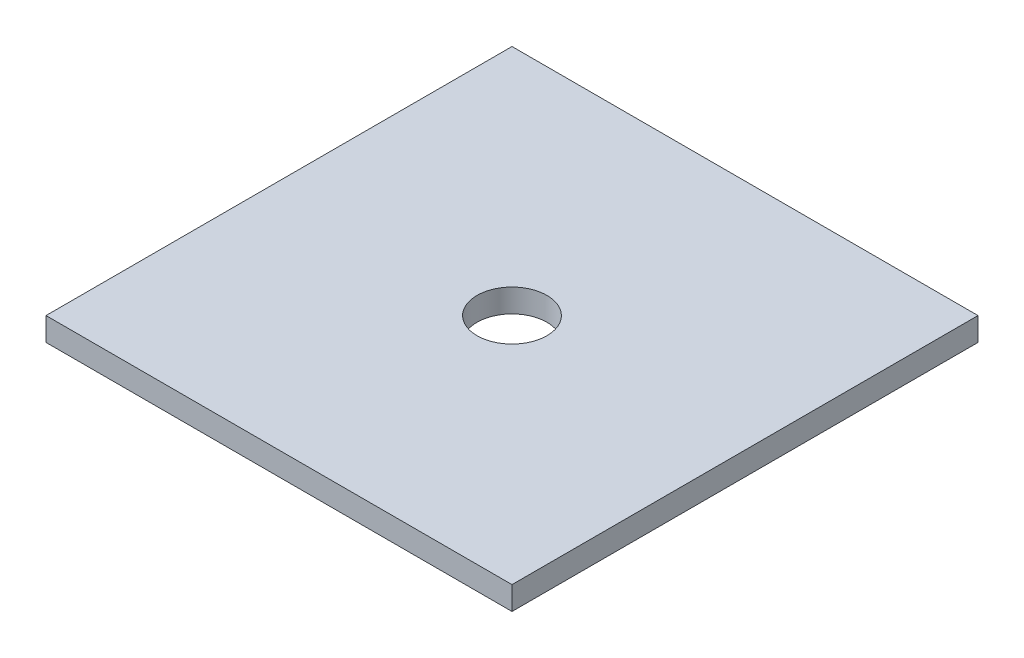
from build123d import *

# Parameters (mm, degrees)
SKETCH1_W      = 60
SKETCH1_H      = 60
SKETCH1_R      = 4.5
EXTRUDE1_DEPTH = 3


with BuildPart() as part:
    # Sketch1 → Extrude1 (new body)
    with BuildSketch(Plane(origin=(0, 0, 0), x_dir=(1, 0, 0), z_dir=(0, 1, 0))):
        with Locations((30, 30)):
            Rectangle(SKETCH1_W, SKETCH1_H)
        with Locations(Location((30, 30, 0), (0, 0, 270))):
            Circle(SKETCH1_R, mode=Mode.SUBTRACT)
    extrude(amount=EXTRUDE1_DEPTH)


solid = part.part
